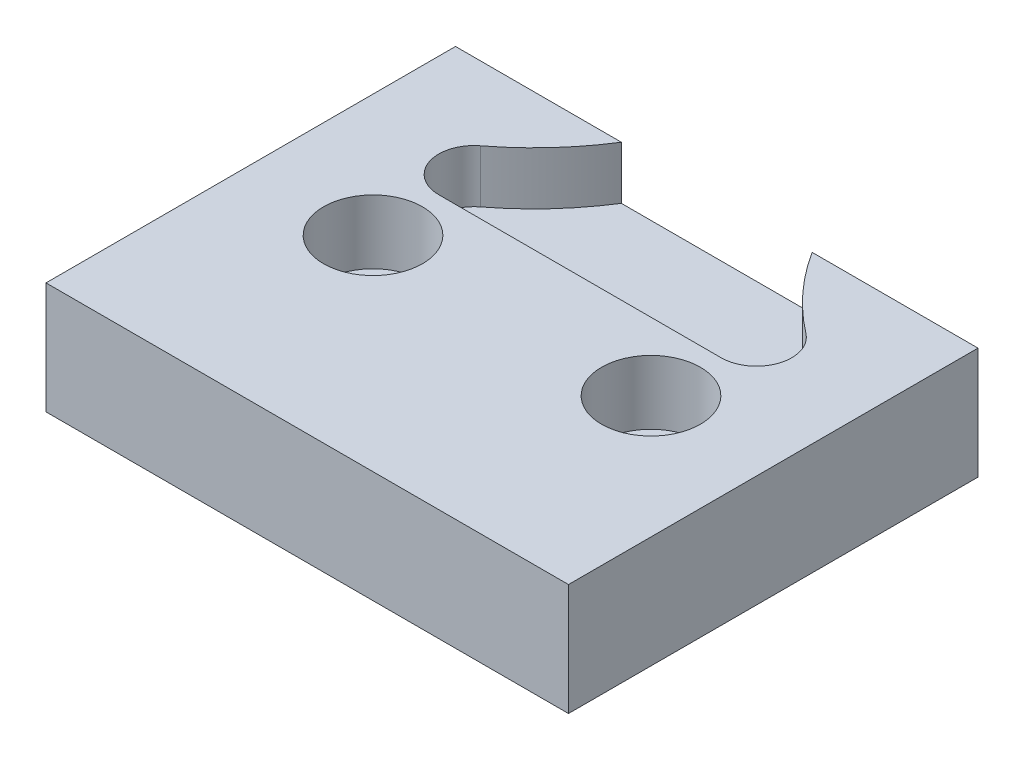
ISO-10303-21;
HEADER;
FILE_DESCRIPTION(('STEP AP214'),'2;1');
FILE_NAME('part.step','',(''),(''),'','','');
FILE_SCHEMA(('AUTOMOTIVE_DESIGN { 1 0 10303 214 1 1 1 1 }'));
ENDSEC;
DATA;
#1=APPLICATION_CONTEXT('core data for automotive mechanical design processes');
#2=APPLICATION_PROTOCOL_DEFINITION('international standard','automotive_design',2000,#1);
#3=PRODUCT_CONTEXT('',#1,'mechanical');
#4=PRODUCT('Part','Part','',(#3));
#5=PRODUCT_RELATED_PRODUCT_CATEGORY('part','',(#4));
#6=PRODUCT_DEFINITION_FORMATION('','',#4);
#7=PRODUCT_DEFINITION_CONTEXT('part definition',#1,'design');
#8=PRODUCT_DEFINITION('design','',#6,#7);
#9=PRODUCT_DEFINITION_SHAPE('','',#8);
#10=(LENGTH_UNIT() NAMED_UNIT(*) SI_UNIT(.MILLI.,.METRE.));
#11=(NAMED_UNIT(*) PLANE_ANGLE_UNIT() SI_UNIT($,.RADIAN.));
#12=(NAMED_UNIT(*) SI_UNIT($,.STERADIAN.) SOLID_ANGLE_UNIT());
#13=UNCERTAINTY_MEASURE_WITH_UNIT(LENGTH_MEASURE(1.E-05),#10,'distance_accuracy_value','');
#14=(GEOMETRIC_REPRESENTATION_CONTEXT(3) GLOBAL_UNCERTAINTY_ASSIGNED_CONTEXT((#13)) GLOBAL_UNIT_ASSIGNED_CONTEXT((#10,
#11,#12)) REPRESENTATION_CONTEXT('',''));
#15=CARTESIAN_POINT('',(0.,0.,0.));
#16=DIRECTION('',(0.,0.,1.));
#17=DIRECTION('',(1.,0.,0.));
#18=AXIS2_PLACEMENT_3D('',#15,#16,#17);
#19=CARTESIAN_POINT('',(0.,0.,0.));
#20=DIRECTION('',(0.,1.,0.));
#21=DIRECTION('',(0.,0.,1.));
#22=AXIS2_PLACEMENT_3D('',#19,#20,#21);
#23=PLANE('',#22);
#24=CARTESIAN_POINT('',(24.99995,0.,0.));
#25=DIRECTION('',(0.,1.,0.));
#26=DIRECTION('',(0.,0.,1.));
#27=AXIS2_PLACEMENT_3D('',#24,#25,#26);
#28=CIRCLE('',#27,8.89);
#29=CARTESIAN_POINT('',(24.99995,0.,8.89));
#30=VERTEX_POINT('',#29);
#31=EDGE_CURVE('E208',#30,#30,#28,.T.);
#32=ORIENTED_EDGE('',*,*,#31,.F.);
#33=EDGE_LOOP('',(#32));
#34=FACE_BOUND('',#33,.T.);
#35=CARTESIAN_POINT('',(-24.99995,0.,0.));
#36=DIRECTION('',(0.,1.,0.));
#37=DIRECTION('',(0.,0.,1.));
#38=AXIS2_PLACEMENT_3D('',#35,#36,#37);
#39=CIRCLE('',#38,8.89);
#40=CARTESIAN_POINT('',(-24.99995,0.,8.89));
#41=VERTEX_POINT('',#40);
#42=EDGE_CURVE('E192',#41,#41,#39,.T.);
#43=ORIENTED_EDGE('',*,*,#42,.F.);
#44=EDGE_LOOP('',(#43));
#45=FACE_BOUND('',#44,.T.);
#46=CARTESIAN_POINT('',(-60.0846810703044,0.,-63.9950217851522));
#47=DIRECTION('',(0.,1.,0.));
#48=DIRECTION('',(0.,0.,1.));
#49=AXIS2_PLACEMENT_3D('',#46,#47,#48);
#50=CIRCLE('',#49,50.8);
#51=CARTESIAN_POINT('',(-17.1579808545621,0.,-36.83));
#52=VERTEX_POINT('',#51);
#53=CARTESIAN_POINT('',(-29.2538090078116,0.,-23.620557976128));
#54=VERTEX_POINT('',#53);
#55=EDGE_CURVE('E55',#52,#54,#50,.F.);
#56=ORIENTED_EDGE('',*,*,#55,.F.);
#57=DIRECTION('',(-1.,0.,0.));
#58=VECTOR('',#57,1.);
#59=CARTESIAN_POINT('',(-46.99,0.,-36.83));
#60=LINE('',#59,#58);
#61=CARTESIAN_POINT('',(-46.99,0.,-36.83));
#62=VERTEX_POINT('',#61);
#63=EDGE_CURVE('E283',#52,#62,#60,.T.);
#64=ORIENTED_EDGE('',*,*,#63,.T.);
#65=DIRECTION('',(0.,0.,1.));
#66=VECTOR('',#65,1.);
#67=CARTESIAN_POINT('',(-46.99,0.,-36.83));
#68=LINE('',#67,#66);
#69=CARTESIAN_POINT('',(-46.99,0.,36.83));
#70=VERTEX_POINT('',#69);
#71=EDGE_CURVE('E288',#62,#70,#68,.T.);
#72=ORIENTED_EDGE('',*,*,#71,.T.);
#73=DIRECTION('',(1.,0.,0.));
#74=VECTOR('',#73,1.);
#75=CARTESIAN_POINT('',(-46.99,0.,36.83));
#76=LINE('',#75,#74);
#77=CARTESIAN_POINT('',(46.99,0.,36.83));
#78=VERTEX_POINT('',#77);
#79=EDGE_CURVE('E292',#70,#78,#76,.T.);
#80=ORIENTED_EDGE('',*,*,#79,.T.);
#81=DIRECTION('',(0.,0.,-1.));
#82=VECTOR('',#81,1.);
#83=CARTESIAN_POINT('',(46.99,0.,-36.83));
#84=LINE('',#83,#82);
#85=CARTESIAN_POINT('',(46.99,0.,-36.83));
#86=VERTEX_POINT('',#85);
#87=EDGE_CURVE('E279',#78,#86,#84,.T.);
#88=ORIENTED_EDGE('',*,*,#87,.T.);
#89=CARTESIAN_POINT('',(17.1580808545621,0.,-36.83));
#90=VERTEX_POINT('',#89);
#91=EDGE_CURVE('E284',#86,#90,#60,.T.);
#92=ORIENTED_EDGE('',*,*,#91,.T.);
#93=CARTESIAN_POINT('',(60.0847810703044,0.,-63.9950217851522));
#94=DIRECTION('',(0.,-1.,0.));
#95=DIRECTION('',(0.,0.,1.));
#96=AXIS2_PLACEMENT_3D('',#93,#94,#95);
#97=CIRCLE('',#96,50.8);
#98=CARTESIAN_POINT('',(29.2539090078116,0.,-23.620557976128));
#99=VERTEX_POINT('',#98);
#100=EDGE_CURVE('E179',#99,#90,#97,.T.);
#101=ORIENTED_EDGE('',*,*,#100,.F.);
#102=CARTESIAN_POINT('',(25.40005,0.,-18.57375));
#103=DIRECTION('',(0.,1.,0.));
#104=DIRECTION('',(0.,0.,1.));
#105=AXIS2_PLACEMENT_3D('',#102,#103,#104);
#106=CIRCLE('',#105,6.34999999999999);
#107=CARTESIAN_POINT('',(25.40005,0.,-12.22375));
#108=VERTEX_POINT('',#107);
#109=EDGE_CURVE('E62',#108,#99,#106,.T.);
#110=ORIENTED_EDGE('',*,*,#109,.F.);
#111=DIRECTION('',(1.,0.,0.));
#112=VECTOR('',#111,1.);
#113=CARTESIAN_POINT('',(-25.39995,0.,-12.22375));
#114=LINE('',#113,#112);
#115=CARTESIAN_POINT('',(-25.39995,0.,-12.22375));
#116=VERTEX_POINT('',#115);
#117=EDGE_CURVE('E168',#116,#108,#114,.T.);
#118=ORIENTED_EDGE('',*,*,#117,.F.);
#119=CARTESIAN_POINT('',(-25.39995,0.,-18.57375));
#120=DIRECTION('',(0.,1.,0.));
#121=DIRECTION('',(0.,0.,1.));
#122=AXIS2_PLACEMENT_3D('',#119,#120,#121);
#123=CIRCLE('',#122,6.34999999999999);
#124=EDGE_CURVE('E171',#54,#116,#123,.T.);
#125=ORIENTED_EDGE('',*,*,#124,.F.);
#126=EDGE_LOOP('',(#56,#64,#72,#80,#88,#92,#101,#110,#118,#125));
#127=FACE_BOUND('',#126,.T.);
#128=ADVANCED_FACE('F47',(#34,#45,#127),#23,.T.);
#129=CARTESIAN_POINT('',(46.99,-24.28875,-36.83));
#130=DIRECTION('',(1.,0.,0.));
#131=DIRECTION('',(0.,0.,-1.));
#132=AXIS2_PLACEMENT_3D('',#129,#130,#131);
#133=PLANE('',#132);
#134=DIRECTION('',(0.,1.,0.));
#135=VECTOR('',#134,1.);
#136=CARTESIAN_POINT('',(46.99,-24.28875,36.83));
#137=LINE('',#136,#135);
#138=CARTESIAN_POINT('',(46.99,-20.09775,36.83));
#139=VERTEX_POINT('',#138);
#140=EDGE_CURVE('E297',#139,#78,#137,.T.);
#141=ORIENTED_EDGE('',*,*,#140,.F.);
#142=DIRECTION('',(0.,0.,-1.));
#143=VECTOR('',#142,1.);
#144=CARTESIAN_POINT('',(46.99,-20.09775,-36.83));
#145=LINE('',#144,#143);
#146=CARTESIAN_POINT('',(46.99,-20.09775,-36.83));
#147=VERTEX_POINT('',#146);
#148=EDGE_CURVE('E275',#139,#147,#145,.T.);
#149=ORIENTED_EDGE('',*,*,#148,.T.);
#150=DIRECTION('',(0.,1.,0.));
#151=VECTOR('',#150,1.);
#152=CARTESIAN_POINT('',(46.99,-24.28875,-36.83));
#153=LINE('',#152,#151);
#154=EDGE_CURVE('E296',#147,#86,#153,.T.);
#155=ORIENTED_EDGE('',*,*,#154,.T.);
#156=ORIENTED_EDGE('',*,*,#87,.F.);
#157=EDGE_LOOP('',(#141,#149,#155,#156));
#158=FACE_BOUND('',#157,.T.);
#159=ADVANCED_FACE('F49',(#158),#133,.T.);
#160=CARTESIAN_POINT('',(-46.99,-24.28875,36.83));
#161=DIRECTION('',(0.,0.,1.));
#162=DIRECTION('',(1.,0.,0.));
#163=AXIS2_PLACEMENT_3D('',#160,#161,#162);
#164=PLANE('',#163);
#165=DIRECTION('',(0.,1.,0.));
#166=VECTOR('',#165,1.);
#167=CARTESIAN_POINT('',(-46.99,-24.28875,36.83));
#168=LINE('',#167,#166);
#169=CARTESIAN_POINT('',(-46.99,-20.09775,36.83));
#170=VERTEX_POINT('',#169);
#171=EDGE_CURVE('E301',#170,#70,#168,.T.);
#172=ORIENTED_EDGE('',*,*,#171,.F.);
#173=DIRECTION('',(1.,0.,0.));
#174=VECTOR('',#173,1.);
#175=CARTESIAN_POINT('',(-46.99,-20.09775,36.83));
#176=LINE('',#175,#174);
#177=EDGE_CURVE('E271',#170,#139,#176,.T.);
#178=ORIENTED_EDGE('',*,*,#177,.T.);
#179=ORIENTED_EDGE('',*,*,#140,.T.);
#180=ORIENTED_EDGE('',*,*,#79,.F.);
#181=EDGE_LOOP('',(#172,#178,#179,#180));
#182=FACE_BOUND('',#181,.T.);
#183=ADVANCED_FACE('F368',(#182),#164,.T.);
#184=CARTESIAN_POINT('',(-46.99,-24.28875,-36.83));
#185=DIRECTION('',(-1.,0.,0.));
#186=DIRECTION('',(0.,0.,1.));
#187=AXIS2_PLACEMENT_3D('',#184,#185,#186);
#188=PLANE('',#187);
#189=DIRECTION('',(0.,1.,0.));
#190=VECTOR('',#189,1.);
#191=CARTESIAN_POINT('',(-46.99,-24.28875,-36.83));
#192=LINE('',#191,#190);
#193=CARTESIAN_POINT('',(-46.99,-20.09775,-36.83));
#194=VERTEX_POINT('',#193);
#195=EDGE_CURVE('E304',#194,#62,#192,.T.);
#196=ORIENTED_EDGE('',*,*,#195,.F.);
#197=DIRECTION('',(0.,0.,1.));
#198=VECTOR('',#197,1.);
#199=CARTESIAN_POINT('',(-46.99,-20.09775,-36.83));
#200=LINE('',#199,#198);
#201=EDGE_CURVE('E70',#194,#170,#200,.T.);
#202=ORIENTED_EDGE('',*,*,#201,.T.);
#203=ORIENTED_EDGE('',*,*,#171,.T.);
#204=ORIENTED_EDGE('',*,*,#71,.F.);
#205=EDGE_LOOP('',(#196,#202,#203,#204));
#206=FACE_BOUND('',#205,.T.);
#207=ADVANCED_FACE('F374',(#206),#188,.T.);
#208=CARTESIAN_POINT('',(-46.99,-24.28875,-36.83));
#209=DIRECTION('',(0.,0.,-1.));
#210=DIRECTION('',(-1.,0.,0.));
#211=AXIS2_PLACEMENT_3D('',#208,#209,#210);
#212=PLANE('',#211);
#213=DIRECTION('',(0.,1.,0.));
#214=VECTOR('',#213,1.);
#215=CARTESIAN_POINT('',(-17.1579808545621,-9.525,-36.83));
#216=LINE('',#215,#214);
#217=CARTESIAN_POINT('',(-17.1579808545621,-9.525,-36.83));
#218=VERTEX_POINT('',#217);
#219=EDGE_CURVE('E190',#218,#52,#216,.T.);
#220=ORIENTED_EDGE('',*,*,#219,.F.);
#221=DIRECTION('',(1.,0.,0.));
#222=VECTOR('',#221,1.);
#223=CARTESIAN_POINT('',(-46.99,-9.525,-36.83));
#224=LINE('',#223,#222);
#225=CARTESIAN_POINT('',(17.1580808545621,-9.525,-36.83));
#226=VERTEX_POINT('',#225);
#227=EDGE_CURVE('E11',#218,#226,#224,.T.);
#228=ORIENTED_EDGE('',*,*,#227,.T.);
#229=DIRECTION('',(0.,1.,0.));
#230=VECTOR('',#229,1.);
#231=CARTESIAN_POINT('',(17.1580808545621,-9.525,-36.83));
#232=LINE('',#231,#230);
#233=EDGE_CURVE('E161',#90,#226,#232,.F.);
#234=ORIENTED_EDGE('',*,*,#233,.F.);
#235=ORIENTED_EDGE('',*,*,#91,.F.);
#236=ORIENTED_EDGE('',*,*,#154,.F.);
#237=DIRECTION('',(-1.,0.,0.));
#238=VECTOR('',#237,1.);
#239=CARTESIAN_POINT('',(-46.99,-20.09775,-36.83));
#240=LINE('',#239,#238);
#241=EDGE_CURVE('E300',#147,#194,#240,.T.);
#242=ORIENTED_EDGE('',*,*,#241,.T.);
#243=ORIENTED_EDGE('',*,*,#195,.T.);
#244=ORIENTED_EDGE('',*,*,#63,.F.);
#245=EDGE_LOOP('',(#220,#228,#234,#235,#236,#242,#243,#244));
#246=FACE_BOUND('',#245,.T.);
#247=ADVANCED_FACE('F327',(#246),#212,.T.);
#248=CARTESIAN_POINT('',(0.,-20.09775,0.));
#249=DIRECTION('',(0.,-1.,0.));
#250=DIRECTION('',(0.,0.,-1.));
#251=AXIS2_PLACEMENT_3D('',#248,#249,#250);
#252=PLANE('',#251);
#253=ORIENTED_EDGE('',*,*,#177,.F.);
#254=ORIENTED_EDGE('',*,*,#201,.F.);
#255=ORIENTED_EDGE('',*,*,#241,.F.);
#256=ORIENTED_EDGE('',*,*,#148,.F.);
#257=EDGE_LOOP('',(#253,#254,#255,#256));
#258=FACE_BOUND('',#257,.T.);
#259=DIRECTION('',(1.,0.,0.));
#260=VECTOR('',#259,1.);
#261=CARTESIAN_POINT('',(-34.925,-20.09775,-6.985));
#262=LINE('',#261,#260);
#263=CARTESIAN_POINT('',(-34.925,-20.09775,-6.985));
#264=VERTEX_POINT('',#263);
#265=CARTESIAN_POINT('',(34.925,-20.09775,-6.985));
#266=VERTEX_POINT('',#265);
#267=EDGE_CURVE('E238',#264,#266,#262,.T.);
#268=ORIENTED_EDGE('',*,*,#267,.F.);
#269=DIRECTION('',(0.,0.,-1.));
#270=VECTOR('',#269,1.);
#271=CARTESIAN_POINT('',(-34.925,-20.09775,6.985));
#272=LINE('',#271,#270);
#273=CARTESIAN_POINT('',(-34.925,-20.09775,6.985));
#274=VERTEX_POINT('',#273);
#275=EDGE_CURVE('E234',#274,#264,#272,.T.);
#276=ORIENTED_EDGE('',*,*,#275,.F.);
#277=DIRECTION('',(-1.,0.,0.));
#278=VECTOR('',#277,1.);
#279=CARTESIAN_POINT('',(-34.925,-20.09775,6.985));
#280=LINE('',#279,#278);
#281=CARTESIAN_POINT('',(34.925,-20.09775,6.985));
#282=VERTEX_POINT('',#281);
#283=EDGE_CURVE('E229',#282,#274,#280,.T.);
#284=ORIENTED_EDGE('',*,*,#283,.F.);
#285=DIRECTION('',(0.,0.,1.));
#286=VECTOR('',#285,1.);
#287=CARTESIAN_POINT('',(34.925,-20.09775,6.985));
#288=LINE('',#287,#286);
#289=EDGE_CURVE('E225',#266,#282,#288,.T.);
#290=ORIENTED_EDGE('',*,*,#289,.F.);
#291=EDGE_LOOP('',(#268,#276,#284,#290));
#292=FACE_BOUND('',#291,.T.);
#293=ADVANCED_FACE('F383',(#258,#292),#252,.T.);
#294=CARTESIAN_POINT('',(34.925,-20.09775,6.985));
#295=DIRECTION('',(1.,0.,0.));
#296=DIRECTION('',(0.,0.,-1.));
#297=AXIS2_PLACEMENT_3D('',#294,#295,#296);
#298=PLANE('',#297);
#299=DIRECTION('',(0.,0.,1.));
#300=VECTOR('',#299,1.);
#301=CARTESIAN_POINT('',(34.925,-24.28875,6.985));
#302=LINE('',#301,#300);
#303=CARTESIAN_POINT('',(34.925,-24.28875,-6.985));
#304=VERTEX_POINT('',#303);
#305=CARTESIAN_POINT('',(34.925,-24.28875,6.985));
#306=VERTEX_POINT('',#305);
#307=EDGE_CURVE('E224',#304,#306,#302,.T.);
#308=ORIENTED_EDGE('',*,*,#307,.F.);
#309=DIRECTION('',(0.,-1.,0.));
#310=VECTOR('',#309,1.);
#311=CARTESIAN_POINT('',(34.925,-20.09775,-6.985));
#312=LINE('',#311,#310);
#313=EDGE_CURVE('E257',#266,#304,#312,.T.);
#314=ORIENTED_EDGE('',*,*,#313,.F.);
#315=ORIENTED_EDGE('',*,*,#289,.T.);
#316=DIRECTION('',(0.,-1.,0.));
#317=VECTOR('',#316,1.);
#318=CARTESIAN_POINT('',(34.925,-20.09775,6.985));
#319=LINE('',#318,#317);
#320=EDGE_CURVE('E242',#282,#306,#319,.T.);
#321=ORIENTED_EDGE('',*,*,#320,.T.);
#322=EDGE_LOOP('',(#308,#314,#315,#321));
#323=FACE_BOUND('',#322,.T.);
#324=ADVANCED_FACE('F403',(#323),#298,.T.);
#325=CARTESIAN_POINT('',(-34.925,-20.09775,-6.985));
#326=DIRECTION('',(0.,0.,-1.));
#327=DIRECTION('',(-1.,0.,0.));
#328=AXIS2_PLACEMENT_3D('',#325,#326,#327);
#329=PLANE('',#328);
#330=DIRECTION('',(1.,0.,0.));
#331=VECTOR('',#330,1.);
#332=CARTESIAN_POINT('',(-34.925,-24.28875,-6.985));
#333=LINE('',#332,#331);
#334=CARTESIAN_POINT('',(-34.925,-24.28875,-6.985));
#335=VERTEX_POINT('',#334);
#336=EDGE_CURVE('E230',#335,#304,#333,.T.);
#337=ORIENTED_EDGE('',*,*,#336,.F.);
#338=DIRECTION('',(0.,-1.,0.));
#339=VECTOR('',#338,1.);
#340=CARTESIAN_POINT('',(-34.925,-20.09775,-6.985));
#341=LINE('',#340,#339);
#342=EDGE_CURVE('E260',#264,#335,#341,.T.);
#343=ORIENTED_EDGE('',*,*,#342,.F.);
#344=ORIENTED_EDGE('',*,*,#267,.T.);
#345=ORIENTED_EDGE('',*,*,#313,.T.);
#346=EDGE_LOOP('',(#337,#343,#344,#345));
#347=FACE_BOUND('',#346,.T.);
#348=ADVANCED_FACE('F406',(#347),#329,.T.);
#349=CARTESIAN_POINT('',(-34.925,-20.09775,6.985));
#350=DIRECTION('',(-1.,0.,0.));
#351=DIRECTION('',(0.,0.,1.));
#352=AXIS2_PLACEMENT_3D('',#349,#350,#351);
#353=PLANE('',#352);
#354=DIRECTION('',(0.,0.,-1.));
#355=VECTOR('',#354,1.);
#356=CARTESIAN_POINT('',(-34.925,-24.28875,6.985));
#357=LINE('',#356,#355);
#358=CARTESIAN_POINT('',(-34.925,-24.28875,6.985));
#359=VERTEX_POINT('',#358);
#360=EDGE_CURVE('E250',#359,#335,#357,.T.);
#361=ORIENTED_EDGE('',*,*,#360,.F.);
#362=DIRECTION('',(0.,-1.,0.));
#363=VECTOR('',#362,1.);
#364=CARTESIAN_POINT('',(-34.925,-20.09775,6.985));
#365=LINE('',#364,#363);
#366=EDGE_CURVE('E263',#274,#359,#365,.T.);
#367=ORIENTED_EDGE('',*,*,#366,.F.);
#368=ORIENTED_EDGE('',*,*,#275,.T.);
#369=ORIENTED_EDGE('',*,*,#342,.T.);
#370=EDGE_LOOP('',(#361,#367,#368,#369));
#371=FACE_BOUND('',#370,.T.);
#372=ADVANCED_FACE('F410',(#371),#353,.T.);
#373=CARTESIAN_POINT('',(-34.925,-20.09775,6.985));
#374=DIRECTION('',(0.,0.,1.));
#375=DIRECTION('',(1.,0.,0.));
#376=AXIS2_PLACEMENT_3D('',#373,#374,#375);
#377=PLANE('',#376);
#378=DIRECTION('',(-1.,0.,0.));
#379=VECTOR('',#378,1.);
#380=CARTESIAN_POINT('',(-34.925,-24.28875,6.985));
#381=LINE('',#380,#379);
#382=EDGE_CURVE('E246',#306,#359,#381,.T.);
#383=ORIENTED_EDGE('',*,*,#382,.F.);
#384=ORIENTED_EDGE('',*,*,#320,.F.);
#385=ORIENTED_EDGE('',*,*,#283,.T.);
#386=ORIENTED_EDGE('',*,*,#366,.T.);
#387=EDGE_LOOP('',(#383,#384,#385,#386));
#388=FACE_BOUND('',#387,.T.);
#389=ADVANCED_FACE('F399',(#388),#377,.T.);
#390=CARTESIAN_POINT('',(0.,-24.28875,0.));
#391=DIRECTION('',(0.,1.,0.));
#392=DIRECTION('',(0.,0.,1.));
#393=AXIS2_PLACEMENT_3D('',#390,#391,#392);
#394=PLANE('',#393);
#395=CARTESIAN_POINT('',(-24.99995,-24.28875,0.));
#396=DIRECTION('',(0.,1.,0.));
#397=DIRECTION('',(0.,0.,1.));
#398=AXIS2_PLACEMENT_3D('',#395,#396,#397);
#399=CIRCLE('',#398,5.55625);
#400=CARTESIAN_POINT('',(-24.99995,-24.28875,5.55625));
#401=VERTEX_POINT('',#400);
#402=EDGE_CURVE('E204',#401,#401,#399,.T.);
#403=ORIENTED_EDGE('',*,*,#402,.T.);
#404=EDGE_LOOP('',(#403));
#405=FACE_BOUND('',#404,.T.);
#406=CARTESIAN_POINT('',(24.99995,-24.28875,0.));
#407=DIRECTION('',(0.,1.,0.));
#408=DIRECTION('',(0.,0.,1.));
#409=AXIS2_PLACEMENT_3D('',#406,#407,#408);
#410=CIRCLE('',#409,5.55625);
#411=CARTESIAN_POINT('',(24.99995,-24.28875,5.55625));
#412=VERTEX_POINT('',#411);
#413=EDGE_CURVE('E220',#412,#412,#410,.T.);
#414=ORIENTED_EDGE('',*,*,#413,.T.);
#415=EDGE_LOOP('',(#414));
#416=FACE_BOUND('',#415,.T.);
#417=ORIENTED_EDGE('',*,*,#307,.T.);
#418=ORIENTED_EDGE('',*,*,#382,.T.);
#419=ORIENTED_EDGE('',*,*,#360,.T.);
#420=ORIENTED_EDGE('',*,*,#336,.T.);
#421=EDGE_LOOP('',(#417,#418,#419,#420));
#422=FACE_BOUND('',#421,.T.);
#423=ADVANCED_FACE('F395',(#405,#416,#422),#394,.F.);
#424=CARTESIAN_POINT('',(24.99995,0.,0.));
#425=DIRECTION('',(0.,1.,0.));
#426=DIRECTION('',(0.,0.,1.));
#427=AXIS2_PLACEMENT_3D('',#424,#425,#426);
#428=CYLINDRICAL_SURFACE('',#427,5.55625);
#429=ORIENTED_EDGE('',*,*,#413,.F.);
#430=EDGE_LOOP('',(#429));
#431=FACE_BOUND('',#430,.T.);
#432=CARTESIAN_POINT('',(24.99995,-11.509375,0.));
#433=DIRECTION('',(0.,1.,0.));
#434=DIRECTION('',(0.,0.,1.));
#435=AXIS2_PLACEMENT_3D('',#432,#433,#434);
#436=CIRCLE('',#435,5.55625);
#437=CARTESIAN_POINT('',(24.99995,-11.509375,5.55625));
#438=VERTEX_POINT('',#437);
#439=EDGE_CURVE('E216',#438,#438,#436,.T.);
#440=ORIENTED_EDGE('',*,*,#439,.T.);
#441=EDGE_LOOP('',(#440));
#442=FACE_BOUND('',#441,.T.);
#443=ADVANCED_FACE('F398',(#431,#442),#428,.F.);
#444=CARTESIAN_POINT('',(30.5562,-11.509375,0.));
#445=DIRECTION('',(0.,-1.,0.));
#446=DIRECTION('',(0.,0.,-1.));
#447=AXIS2_PLACEMENT_3D('',#444,#445,#446);
#448=PLANE('',#447);
#449=ORIENTED_EDGE('',*,*,#439,.F.);
#450=EDGE_LOOP('',(#449));
#451=FACE_BOUND('',#450,.T.);
#452=CARTESIAN_POINT('',(24.99995,-11.509375,0.));
#453=DIRECTION('',(0.,1.,0.));
#454=DIRECTION('',(0.,0.,1.));
#455=AXIS2_PLACEMENT_3D('',#452,#453,#454);
#456=CIRCLE('',#455,8.89);
#457=CARTESIAN_POINT('',(24.99995,-11.509375,8.89));
#458=VERTEX_POINT('',#457);
#459=EDGE_CURVE('E212',#458,#458,#456,.T.);
#460=ORIENTED_EDGE('',*,*,#459,.T.);
#461=EDGE_LOOP('',(#460));
#462=FACE_BOUND('',#461,.T.);
#463=ADVANCED_FACE('F420',(#451,#462),#448,.F.);
#464=CARTESIAN_POINT('',(24.99995,0.,0.));
#465=DIRECTION('',(0.,1.,0.));
#466=DIRECTION('',(0.,0.,1.));
#467=AXIS2_PLACEMENT_3D('',#464,#465,#466);
#468=CYLINDRICAL_SURFACE('',#467,8.89);
#469=ORIENTED_EDGE('',*,*,#459,.F.);
#470=EDGE_LOOP('',(#469));
#471=FACE_BOUND('',#470,.T.);
#472=ORIENTED_EDGE('',*,*,#31,.T.);
#473=EDGE_LOOP('',(#472));
#474=FACE_BOUND('',#473,.T.);
#475=ADVANCED_FACE('F424',(#471,#474),#468,.F.);
#476=CARTESIAN_POINT('',(-24.99995,0.,0.));
#477=DIRECTION('',(0.,1.,0.));
#478=DIRECTION('',(0.,0.,1.));
#479=AXIS2_PLACEMENT_3D('',#476,#477,#478);
#480=CYLINDRICAL_SURFACE('',#479,5.55625);
#481=ORIENTED_EDGE('',*,*,#402,.F.);
#482=EDGE_LOOP('',(#481));
#483=FACE_BOUND('',#482,.T.);
#484=CARTESIAN_POINT('',(-24.99995,-11.509375,0.));
#485=DIRECTION('',(0.,1.,0.));
#486=DIRECTION('',(0.,0.,1.));
#487=AXIS2_PLACEMENT_3D('',#484,#485,#486);
#488=CIRCLE('',#487,5.55625);
#489=CARTESIAN_POINT('',(-24.99995,-11.509375,5.55625));
#490=VERTEX_POINT('',#489);
#491=EDGE_CURVE('E200',#490,#490,#488,.T.);
#492=ORIENTED_EDGE('',*,*,#491,.T.);
#493=EDGE_LOOP('',(#492));
#494=FACE_BOUND('',#493,.T.);
#495=ADVANCED_FACE('F428',(#483,#494),#480,.F.);
#496=CARTESIAN_POINT('',(-19.4437,-11.509375,0.));
#497=DIRECTION('',(0.,-1.,0.));
#498=DIRECTION('',(0.,0.,-1.));
#499=AXIS2_PLACEMENT_3D('',#496,#497,#498);
#500=PLANE('',#499);
#501=ORIENTED_EDGE('',*,*,#491,.F.);
#502=EDGE_LOOP('',(#501));
#503=FACE_BOUND('',#502,.T.);
#504=CARTESIAN_POINT('',(-24.99995,-11.509375,0.));
#505=DIRECTION('',(0.,1.,0.));
#506=DIRECTION('',(0.,0.,1.));
#507=AXIS2_PLACEMENT_3D('',#504,#505,#506);
#508=CIRCLE('',#507,8.89);
#509=CARTESIAN_POINT('',(-24.99995,-11.509375,8.89));
#510=VERTEX_POINT('',#509);
#511=EDGE_CURVE('E196',#510,#510,#508,.T.);
#512=ORIENTED_EDGE('',*,*,#511,.T.);
#513=EDGE_LOOP('',(#512));
#514=FACE_BOUND('',#513,.T.);
#515=ADVANCED_FACE('F432',(#503,#514),#500,.F.);
#516=CARTESIAN_POINT('',(-24.99995,0.,0.));
#517=DIRECTION('',(0.,1.,0.));
#518=DIRECTION('',(0.,0.,1.));
#519=AXIS2_PLACEMENT_3D('',#516,#517,#518);
#520=CYLINDRICAL_SURFACE('',#519,8.89);
#521=ORIENTED_EDGE('',*,*,#511,.F.);
#522=EDGE_LOOP('',(#521));
#523=FACE_BOUND('',#522,.T.);
#524=ORIENTED_EDGE('',*,*,#42,.T.);
#525=EDGE_LOOP('',(#524));
#526=FACE_BOUND('',#525,.T.);
#527=ADVANCED_FACE('F436',(#523,#526),#520,.F.);
#528=CARTESIAN_POINT('',(25.40005,-9.525,-18.57375));
#529=DIRECTION('',(0.,1.,0.));
#530=DIRECTION('',(0.,0.,1.));
#531=AXIS2_PLACEMENT_3D('',#528,#529,#530);
#532=CYLINDRICAL_SURFACE('',#531,6.34999999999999);
#533=ORIENTED_EDGE('',*,*,#109,.T.);
#534=DIRECTION('',(0.,1.,0.));
#535=VECTOR('',#534,1.);
#536=CARTESIAN_POINT('',(29.2539090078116,-9.525,-23.620557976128));
#537=LINE('',#536,#535);
#538=CARTESIAN_POINT('',(29.2539090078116,-9.525,-23.620557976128));
#539=VERTEX_POINT('',#538);
#540=EDGE_CURVE('E146',#539,#99,#537,.T.);
#541=ORIENTED_EDGE('',*,*,#540,.F.);
#542=CARTESIAN_POINT('',(25.40005,-9.525,-18.57375));
#543=DIRECTION('',(0.,1.,0.));
#544=DIRECTION('',(0.,0.,1.));
#545=AXIS2_PLACEMENT_3D('',#542,#543,#544);
#546=CIRCLE('',#545,6.34999999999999);
#547=CARTESIAN_POINT('',(25.40005,-9.525,-12.22375));
#548=VERTEX_POINT('',#547);
#549=EDGE_CURVE('E150',#548,#539,#546,.T.);
#550=ORIENTED_EDGE('',*,*,#549,.F.);
#551=DIRECTION('',(0.,1.,0.));
#552=VECTOR('',#551,1.);
#553=CARTESIAN_POINT('',(25.40005,-9.525,-12.22375));
#554=LINE('',#553,#552);
#555=EDGE_CURVE('E183',#548,#108,#554,.T.);
#556=ORIENTED_EDGE('',*,*,#555,.T.);
#557=EDGE_LOOP('',(#533,#541,#550,#556));
#558=FACE_BOUND('',#557,.T.);
#559=ADVANCED_FACE('F148',(#558),#532,.F.);
#560=CARTESIAN_POINT('',(-25.39995,-9.525,-12.22375));
#561=DIRECTION('',(0.,0.,1.));
#562=DIRECTION('',(1.,0.,0.));
#563=AXIS2_PLACEMENT_3D('',#560,#561,#562);
#564=PLANE('',#563);
#565=ORIENTED_EDGE('',*,*,#117,.T.);
#566=ORIENTED_EDGE('',*,*,#555,.F.);
#567=DIRECTION('',(1.,0.,0.));
#568=VECTOR('',#567,1.);
#569=CARTESIAN_POINT('',(-25.39995,-9.525,-12.22375));
#570=LINE('',#569,#568);
#571=CARTESIAN_POINT('',(-25.39995,-9.525,-12.22375));
#572=VERTEX_POINT('',#571);
#573=EDGE_CURVE('E155',#572,#548,#570,.T.);
#574=ORIENTED_EDGE('',*,*,#573,.F.);
#575=DIRECTION('',(0.,1.,0.));
#576=VECTOR('',#575,1.);
#577=CARTESIAN_POINT('',(-25.39995,-9.525,-12.22375));
#578=LINE('',#577,#576);
#579=EDGE_CURVE('E185',#572,#116,#578,.T.);
#580=ORIENTED_EDGE('',*,*,#579,.T.);
#581=EDGE_LOOP('',(#565,#566,#574,#580));
#582=FACE_BOUND('',#581,.T.);
#583=ADVANCED_FACE('F325',(#582),#564,.F.);
#584=CARTESIAN_POINT('',(-25.39995,-9.525,-18.57375));
#585=DIRECTION('',(0.,1.,0.));
#586=DIRECTION('',(0.,0.,1.));
#587=AXIS2_PLACEMENT_3D('',#584,#585,#586);
#588=CYLINDRICAL_SURFACE('',#587,6.34999999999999);
#589=ORIENTED_EDGE('',*,*,#124,.T.);
#590=ORIENTED_EDGE('',*,*,#579,.F.);
#591=CARTESIAN_POINT('',(-25.39995,-9.525,-18.57375));
#592=DIRECTION('',(0.,1.,0.));
#593=DIRECTION('',(0.,0.,1.));
#594=AXIS2_PLACEMENT_3D('',#591,#592,#593);
#595=CIRCLE('',#594,6.34999999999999);
#596=CARTESIAN_POINT('',(-29.2538090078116,-9.525,-23.620557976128));
#597=VERTEX_POINT('',#596);
#598=EDGE_CURVE('E175',#597,#572,#595,.T.);
#599=ORIENTED_EDGE('',*,*,#598,.F.);
#600=DIRECTION('',(0.,1.,0.));
#601=VECTOR('',#600,1.);
#602=CARTESIAN_POINT('',(-29.2538090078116,-9.525,-23.620557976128));
#603=LINE('',#602,#601);
#604=EDGE_CURVE('E154',#597,#54,#603,.T.);
#605=ORIENTED_EDGE('',*,*,#604,.T.);
#606=EDGE_LOOP('',(#589,#590,#599,#605));
#607=FACE_BOUND('',#606,.T.);
#608=ADVANCED_FACE('F322',(#607),#588,.F.);
#609=CARTESIAN_POINT('',(-60.0846810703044,-9.525,-63.9950217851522));
#610=DIRECTION('',(0.,1.,0.));
#611=DIRECTION('',(0.,0.,1.));
#612=AXIS2_PLACEMENT_3D('',#609,#610,#611);
#613=CYLINDRICAL_SURFACE('',#612,50.8);
#614=ORIENTED_EDGE('',*,*,#219,.T.);
#615=ORIENTED_EDGE('',*,*,#55,.T.);
#616=ORIENTED_EDGE('',*,*,#604,.F.);
#617=CARTESIAN_POINT('',(-60.0846810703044,-9.525,-63.9950217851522));
#618=DIRECTION('',(0.,-1.,0.));
#619=DIRECTION('',(0.,0.,1.));
#620=AXIS2_PLACEMENT_3D('',#617,#618,#619);
#621=CIRCLE('',#620,50.8);
#622=EDGE_CURVE('E163',#218,#597,#621,.T.);
#623=ORIENTED_EDGE('',*,*,#622,.F.);
#624=EDGE_LOOP('',(#614,#615,#616,#623));
#625=FACE_BOUND('',#624,.T.);
#626=ADVANCED_FACE('F314',(#625),#613,.T.);
#627=CARTESIAN_POINT('',(60.0847810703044,-9.525,-63.9950217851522));
#628=DIRECTION('',(0.,1.,0.));
#629=DIRECTION('',(0.,0.,1.));
#630=AXIS2_PLACEMENT_3D('',#627,#628,#629);
#631=CYLINDRICAL_SURFACE('',#630,50.8);
#632=ORIENTED_EDGE('',*,*,#233,.T.);
#633=CARTESIAN_POINT('',(60.0847810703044,-9.525,-63.9950217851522));
#634=DIRECTION('',(0.,-1.,0.));
#635=DIRECTION('',(0.,0.,1.));
#636=AXIS2_PLACEMENT_3D('',#633,#634,#635);
#637=CIRCLE('',#636,50.8);
#638=EDGE_CURVE('E158',#539,#226,#637,.T.);
#639=ORIENTED_EDGE('',*,*,#638,.F.);
#640=ORIENTED_EDGE('',*,*,#540,.T.);
#641=ORIENTED_EDGE('',*,*,#100,.T.);
#642=EDGE_LOOP('',(#632,#639,#640,#641));
#643=FACE_BOUND('',#642,.T.);
#644=ADVANCED_FACE('F159',(#643),#631,.T.);
#645=CARTESIAN_POINT('',(25.40005,-9.525,-18.57375));
#646=DIRECTION('',(0.,1.,0.));
#647=DIRECTION('',(0.,0.,1.));
#648=AXIS2_PLACEMENT_3D('',#645,#646,#647);
#649=PLANE('',#648);
#650=ORIENTED_EDGE('',*,*,#622,.T.);
#651=ORIENTED_EDGE('',*,*,#598,.T.);
#652=ORIENTED_EDGE('',*,*,#573,.T.);
#653=ORIENTED_EDGE('',*,*,#549,.T.);
#654=ORIENTED_EDGE('',*,*,#638,.T.);
#655=ORIENTED_EDGE('',*,*,#227,.F.);
#656=EDGE_LOOP('',(#650,#651,#652,#653,#654,#655));
#657=FACE_BOUND('',#656,.T.);
#658=ADVANCED_FACE('F165',(#657),#649,.T.);
#659=CLOSED_SHELL('',(#128,#159,#183,#207,#247,#293,#324,#348,#372,#389,#423,#443,#463,#475,
#495,#515,#527,#559,#583,#608,#626,#644,#658));
#660=MANIFOLD_SOLID_BREP('B2',#659);
#661=ADVANCED_BREP_SHAPE_REPRESENTATION('',(#18,#660),#14);
#662=SHAPE_DEFINITION_REPRESENTATION(#9,#661);
ENDSEC;
END-ISO-10303-21;
